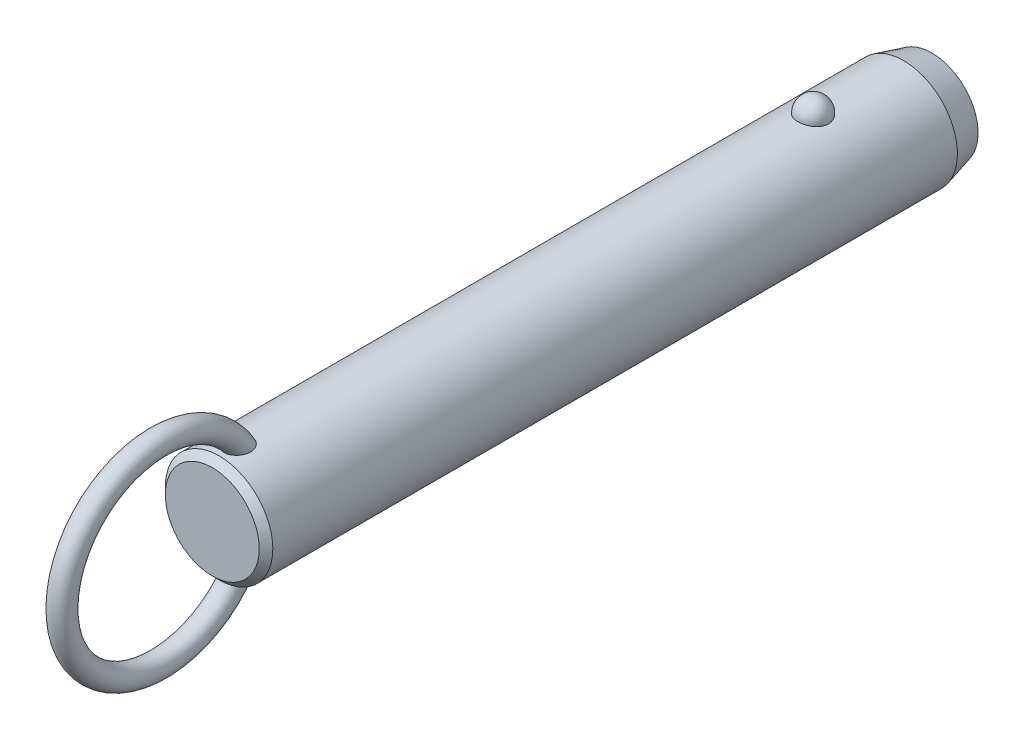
ISO-10303-21;
HEADER;
FILE_DESCRIPTION(('STEP AP214'),'2;1');
FILE_NAME('part.step','',(''),(''),'','','');
FILE_SCHEMA(('AUTOMOTIVE_DESIGN { 1 0 10303 214 1 1 1 1 }'));
ENDSEC;
DATA;
#1=APPLICATION_CONTEXT('core data for automotive mechanical design processes');
#2=APPLICATION_PROTOCOL_DEFINITION('international standard','automotive_design',2000,#1);
#3=PRODUCT_CONTEXT('',#1,'mechanical');
#4=PRODUCT('Part','Part','',(#3));
#5=PRODUCT_RELATED_PRODUCT_CATEGORY('part','',(#4));
#6=PRODUCT_DEFINITION_FORMATION('','',#4);
#7=PRODUCT_DEFINITION_CONTEXT('part definition',#1,'design');
#8=PRODUCT_DEFINITION('design','',#6,#7);
#9=PRODUCT_DEFINITION_SHAPE('','',#8);
#10=(LENGTH_UNIT() NAMED_UNIT(*) SI_UNIT(.MILLI.,.METRE.));
#11=(NAMED_UNIT(*) PLANE_ANGLE_UNIT() SI_UNIT($,.RADIAN.));
#12=(NAMED_UNIT(*) SI_UNIT($,.STERADIAN.) SOLID_ANGLE_UNIT());
#13=UNCERTAINTY_MEASURE_WITH_UNIT(LENGTH_MEASURE(1.E-05),#10,'distance_accuracy_value','');
#14=(GEOMETRIC_REPRESENTATION_CONTEXT(3) GLOBAL_UNCERTAINTY_ASSIGNED_CONTEXT((#13)) GLOBAL_UNIT_ASSIGNED_CONTEXT((#10,
#11,#12)) REPRESENTATION_CONTEXT('',''));
#15=CARTESIAN_POINT('',(0.,0.,0.));
#16=DIRECTION('',(0.,0.,1.));
#17=DIRECTION('',(1.,0.,0.));
#18=AXIS2_PLACEMENT_3D('',#15,#16,#17);
#19=CARTESIAN_POINT('',(0.,0.,94.));
#20=DIRECTION('',(0.,0.,-1.));
#21=DIRECTION('',(-1.,0.,0.));
#22=AXIS2_PLACEMENT_3D('',#19,#20,#21);
#23=CYLINDRICAL_SURFACE('',#22,9.5);
#24=CARTESIAN_POINT('',(2.67259918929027,9.11631578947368,-2.70000000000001));
#25=CARTESIAN_POINT('',(2.6725968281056,9.11631786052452,-2.54909854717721));
#26=CARTESIAN_POINT('',(2.66030567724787,9.11994722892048,-2.39816735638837));
#27=CARTESIAN_POINT('',(2.6114347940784,9.13405924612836,-2.10058568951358));
#28=CARTESIAN_POINT('',(2.57484658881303,9.14454428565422,-1.95393672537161));
#29=CARTESIAN_POINT('',(2.47830875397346,9.17117631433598,-1.66916069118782));
#30=CARTESIAN_POINT('',(2.41836936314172,9.18732082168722,-1.53102991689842));
#31=CARTESIAN_POINT('',(2.27661331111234,9.22346780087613,-1.26705393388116));
#32=CARTESIAN_POINT('',(2.19479699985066,9.24347021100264,-1.14120852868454));
#33=CARTESIAN_POINT('',(2.01085282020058,9.28522401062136,-0.904632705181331));
#34=CARTESIAN_POINT('',(1.90862396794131,9.30698376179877,-0.793982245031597));
#35=CARTESIAN_POINT('',(1.6867437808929,9.34973971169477,-0.591607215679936));
#36=CARTESIAN_POINT('',(1.56709244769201,9.37073591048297,-0.499882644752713));
#37=CARTESIAN_POINT('',(1.31393976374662,9.40956370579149,-0.338167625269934));
#38=CARTESIAN_POINT('',(1.18048026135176,9.42740444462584,-0.268113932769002));
#39=CARTESIAN_POINT('',(0.903154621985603,9.45799906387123,-0.151390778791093));
#40=CARTESIAN_POINT('',(0.759289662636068,9.47075351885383,-0.104718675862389));
#41=CARTESIAN_POINT('',(0.468074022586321,9.48956256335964,-0.0367633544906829));
#42=CARTESIAN_POINT('',(0.320836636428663,9.49573643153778,-0.0150275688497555));
#43=CARTESIAN_POINT('',(0.0246714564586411,9.50112183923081,0.00396199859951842));
#44=CARTESIAN_POINT('',(-0.124256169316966,9.50033406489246,0.00121819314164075));
#45=CARTESIAN_POINT('',(-0.417264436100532,9.4919475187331,-0.0284441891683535));
#46=CARTESIAN_POINT('',(-0.56138413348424,9.48444885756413,-0.0550074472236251));
#47=CARTESIAN_POINT('',(-0.842986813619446,9.46357853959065,-0.131064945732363));
#48=CARTESIAN_POINT('',(-0.980469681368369,9.450206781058,-0.180559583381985));
#49=CARTESIAN_POINT('',(-1.24585005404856,9.41890822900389,-0.301476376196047));
#50=CARTESIAN_POINT('',(-1.37368611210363,9.40095498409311,-0.373026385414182));
#51=CARTESIAN_POINT('',(-1.61552738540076,9.36242964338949,-0.536025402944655));
#52=CARTESIAN_POINT('',(-1.72953116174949,9.34185727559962,-0.627476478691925));
#53=CARTESIAN_POINT('',(-1.9429225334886,9.29984568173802,-0.829844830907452));
#54=CARTESIAN_POINT('',(-2.04198021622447,9.27839736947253,-0.94110821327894));
#55=CARTESIAN_POINT('',(-2.22026460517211,9.23735994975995,-1.17883414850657));
#56=CARTESIAN_POINT('',(-2.29948985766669,9.21777097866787,-1.30529781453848));
#57=CARTESIAN_POINT('',(-2.43697287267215,9.18238994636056,-1.57158566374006));
#58=CARTESIAN_POINT('',(-2.49497068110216,9.16664569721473,-1.71155057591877));
#59=CARTESIAN_POINT('',(-2.5872073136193,9.14104303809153,-1.99961197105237));
#60=CARTESIAN_POINT('',(-2.62144683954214,9.13118445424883,-2.14770821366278));
#61=CARTESIAN_POINT('',(-2.66521466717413,9.11850622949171,-2.44715424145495));
#62=CARTESIAN_POINT('',(-2.67484831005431,9.11565658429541,-2.59848735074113));
#63=CARTESIAN_POINT('',(-2.66946735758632,9.11723375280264,-2.90067317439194));
#64=CARTESIAN_POINT('',(-2.65445345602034,9.12166036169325,-3.05152590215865));
#65=CARTESIAN_POINT('',(-2.60029711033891,9.13724422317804,-3.34766110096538));
#66=CARTESIAN_POINT('',(-2.56127978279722,9.14836656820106,-3.49296833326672));
#67=CARTESIAN_POINT('',(-2.46018844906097,9.17606676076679,-3.77477535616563));
#68=CARTESIAN_POINT('',(-2.39811349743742,9.1926448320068,-3.9112747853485));
#69=CARTESIAN_POINT('',(-2.25202303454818,9.22952198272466,-4.17244273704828));
#70=CARTESIAN_POINT('',(-2.16788714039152,9.24984129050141,-4.29704106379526));
#71=CARTESIAN_POINT('',(-1.9799408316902,9.29188255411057,-4.53013066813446));
#72=CARTESIAN_POINT('',(-1.87612963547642,9.31360456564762,-4.63862130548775));
#73=CARTESIAN_POINT('',(-1.65105429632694,9.35612959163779,-4.8369029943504));
#74=CARTESIAN_POINT('',(-1.52972405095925,9.37692871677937,-4.92661991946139));
#75=CARTESIAN_POINT('',(-1.27318250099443,9.41518970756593,-5.08429106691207));
#76=CARTESIAN_POINT('',(-1.13797219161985,9.432651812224,-5.15224684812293));
#77=CARTESIAN_POINT('',(-0.859280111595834,9.46208255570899,-5.26371827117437));
#78=CARTESIAN_POINT('',(-0.715925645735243,9.47411833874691,-5.30753421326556));
#79=CARTESIAN_POINT('',(-0.423550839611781,9.4916822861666,-5.37076321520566));
#80=CARTESIAN_POINT('',(-0.2745312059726,9.49721125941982,-5.39017930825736));
#81=CARTESIAN_POINT('',(0.0218446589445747,9.50110860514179,-5.40390587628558));
#82=CARTESIAN_POINT('',(0.16917707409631,9.49961381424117,-5.39869609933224));
#83=CARTESIAN_POINT('',(0.460808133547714,9.48993906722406,-5.36441955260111));
#84=CARTESIAN_POINT('',(0.605106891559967,9.48175936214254,-5.33535367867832));
#85=CARTESIAN_POINT('',(0.886027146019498,9.4596376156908,-5.25435587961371));
#86=CARTESIAN_POINT('',(1.02267710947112,9.44571881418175,-5.20251612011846));
#87=CARTESIAN_POINT('',(1.28523827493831,9.41358993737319,-5.07741549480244));
#88=CARTESIAN_POINT('',(1.41114877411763,9.39537958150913,-5.00415322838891));
#89=CARTESIAN_POINT('',(1.65085227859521,9.3562644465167,-4.83684599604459));
#90=CARTESIAN_POINT('',(1.76442346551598,9.33532178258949,-4.74249218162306));
#91=CARTESIAN_POINT('',(1.97425672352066,9.29321198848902,-4.53620389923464));
#92=CARTESIAN_POINT('',(2.07051582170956,9.27204482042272,-4.42426641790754));
#93=CARTESIAN_POINT('',(2.24490086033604,9.23139221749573,-4.18363183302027));
#94=CARTESIAN_POINT('',(2.32267019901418,9.21194380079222,-4.05466990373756));
#95=CARTESIAN_POINT('',(2.45584092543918,9.1773419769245,-3.78517836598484));
#96=CARTESIAN_POINT('',(2.5112497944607,9.16218713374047,-3.64465264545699));
#97=CARTESIAN_POINT('',(2.59380876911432,9.13913522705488,-3.37104301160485));
#98=CARTESIAN_POINT('',(2.62330266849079,9.13064624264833,-3.23871053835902));
#99=CARTESIAN_POINT('',(2.66269870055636,9.11923566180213,-2.97092664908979));
#100=CARTESIAN_POINT('',(2.67260130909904,9.11631393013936,-2.83547530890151));
#101=CARTESIAN_POINT('',(2.67259918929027,9.11631578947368,-2.70000000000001));
#102=B_SPLINE_CURVE_WITH_KNOTS('',3,(#24,#25,#26,#27,#28,#29,#30,#31,#32,#33,#34,#35,#36,#37,
#38,#39,#40,#41,#42,#43,#44,#45,#46,#47,#48,#49,#50,#51,#52,#53,#54,#55,#56,#57,#58,#59,#60,#61,
#62,#63,#64,#65,#66,#67,#68,#69,#70,#71,#72,#73,#74,#75,#76,#77,#78,#79,#80,#81,#82,#83,#84,#85,
#86,#87,#88,#89,#90,#91,#92,#93,#94,#95,#96,#97,#98,#99,#100,#101),.UNSPECIFIED.,.T.,.F.,(4,2,2,
2,2,2,2,2,2,2,2,2,2,2,2,2,2,2,2,2,2,2,2,2,2,2,2,2,2,2,2,2,2,2,2,2,2,2,4),(0.,0.452217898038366,
0.904593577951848,1.35677112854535,1.80894144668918,2.26340676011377,2.71787203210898,
3.17099820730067,3.62407318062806,4.0687883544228,4.51345969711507,4.95160616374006,
5.38976021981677,5.83050358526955,6.27129275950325,6.72071308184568,7.17016633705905,
7.62495278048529,8.07972578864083,8.53254856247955,8.98535859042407,9.43582813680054,
9.88631615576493,10.3393155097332,10.7923328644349,11.2471065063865,11.7018475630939,
12.150795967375,12.599688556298,13.0398725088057,13.4800399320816,13.9184421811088,
14.3568730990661,14.802202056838,15.2476074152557,15.7010097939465,16.1542603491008,
16.5602594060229,16.966248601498),.UNSPECIFIED.);
#103=CARTESIAN_POINT('',(2.67259918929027,9.11631578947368,-2.70000000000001));
#104=VERTEX_POINT('',#103);
#105=EDGE_CURVE('E41',#104,#104,#102,.T.);
#106=ORIENTED_EDGE('',*,*,#105,.T.);
#107=EDGE_LOOP('',(#106));
#108=FACE_BOUND('',#107,.T.);
#109=CARTESIAN_POINT('',(0.,0.,102.32));
#110=DIRECTION('',(0.,0.,1.));
#111=DIRECTION('',(1.,0.,0.));
#112=AXIS2_PLACEMENT_3D('',#109,#110,#111);
#113=CIRCLE('',#112,9.5);
#114=CARTESIAN_POINT('',(9.5,0.,102.32));
#115=VERTEX_POINT('',#114);
#116=EDGE_CURVE('E10',#115,#115,#113,.F.);
#117=ORIENTED_EDGE('',*,*,#116,.T.);
#118=EDGE_LOOP('',(#117));
#119=FACE_BOUND('',#118,.T.);
#120=CARTESIAN_POINT('',(-0.697062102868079,-9.47439269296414,96.6678088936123));
#121=CARTESIAN_POINT('',(-0.799579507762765,-9.46685146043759,96.7074823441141));
#122=CARTESIAN_POINT('',(-0.898575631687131,-9.45788043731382,96.7559309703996));
#123=CARTESIAN_POINT('',(-1.08670047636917,-9.43811593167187,96.8688685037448));
#124=CARTESIAN_POINT('',(-1.17583204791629,-9.42732297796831,96.9333527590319));
#125=CARTESIAN_POINT('',(-1.34179806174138,-9.40513672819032,97.0762099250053));
#126=CARTESIAN_POINT('',(-1.41865133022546,-9.39374438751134,97.154561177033));
#127=CARTESIAN_POINT('',(-1.5586004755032,-9.37154196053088,97.3227524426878));
#128=CARTESIAN_POINT('',(-1.62169476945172,-9.3607319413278,97.4125937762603));
#129=CARTESIAN_POINT('',(-1.73527695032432,-9.34035749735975,97.6045001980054));
#130=CARTESIAN_POINT('',(-1.7852226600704,-9.33085270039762,97.7068910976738));
#131=CARTESIAN_POINT('',(-1.86924997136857,-9.3143834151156,97.918148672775));
#132=CARTESIAN_POINT('',(-1.90332570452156,-9.30741986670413,98.0270177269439));
#133=CARTESIAN_POINT('',(-1.95893603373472,-9.29588482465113,98.2604730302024));
#134=CARTESIAN_POINT('',(-1.97872420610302,-9.29165182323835,98.3854890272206));
#135=CARTESIAN_POINT('',(-2.00062129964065,-9.28695978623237,98.6370805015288));
#136=CARTESIAN_POINT('',(-2.00272284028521,-9.28650232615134,98.763656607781));
#137=CARTESIAN_POINT('',(-1.98958876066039,-9.28932750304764,99.0368157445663));
#138=CARTESIAN_POINT('',(-1.97143366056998,-9.2932400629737,99.1832519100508));
#139=CARTESIAN_POINT('',(-1.91479925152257,-9.30507151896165,99.4720629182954));
#140=CARTESIAN_POINT('',(-1.87629122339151,-9.31299607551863,99.614431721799));
#141=CARTESIAN_POINT('',(-1.77225683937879,-9.33340232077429,99.9151725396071));
#142=CARTESIAN_POINT('',(-1.70334898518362,-9.34641636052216,100.072369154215));
#143=CARTESIAN_POINT('',(-1.58111062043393,-9.36759153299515,100.297517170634));
#144=CARTESIAN_POINT('',(-1.53721459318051,-9.37492619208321,100.370796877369));
#145=CARTESIAN_POINT('',(-1.44302631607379,-9.38988566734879,100.51307405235));
#146=CARTESIAN_POINT('',(-1.39273721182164,-9.39751033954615,100.582073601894));
#147=CARTESIAN_POINT('',(-1.26775962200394,-9.41530678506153,100.736983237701));
#148=CARTESIAN_POINT('',(-1.19052326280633,-9.42548108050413,100.820871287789));
#149=CARTESIAN_POINT('',(-1.02420241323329,-9.44499825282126,100.976008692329));
#150=CARTESIAN_POINT('',(-0.935139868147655,-9.45434261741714,101.047280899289));
#151=CARTESIAN_POINT('',(-0.766610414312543,-9.46930670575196,101.158695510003));
#152=CARTESIAN_POINT('',(-0.689439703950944,-9.47529223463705,101.202235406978));
#153=CARTESIAN_POINT('',(-0.528942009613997,-9.48560294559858,101.27631336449));
#154=CARTESIAN_POINT('',(-0.445620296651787,-9.48992953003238,101.306862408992));
#155=CARTESIAN_POINT('',(-0.273901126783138,-9.49644161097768,101.352579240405));
#156=CARTESIAN_POINT('',(-0.185465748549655,-9.49860811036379,101.36761059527));
#157=CARTESIAN_POINT('',(-0.00734541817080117,-9.5004135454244,101.380149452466));
#158=CARTESIAN_POINT('',(0.0823387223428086,-9.50005405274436,101.377667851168));
#159=CARTESIAN_POINT('',(0.247679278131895,-9.49708301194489,101.356995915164));
#160=CARTESIAN_POINT('',(0.323620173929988,-9.49477609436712,101.340930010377));
#161=CARTESIAN_POINT('',(0.471981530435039,-9.48855917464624,101.297172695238));
#162=CARTESIAN_POINT('',(0.544400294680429,-9.48464840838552,101.269475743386));
#163=CARTESIAN_POINT('',(0.70894789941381,-9.47398336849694,101.19280266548));
#164=CARTESIAN_POINT('',(0.799149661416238,-9.46671310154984,101.139774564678));
#165=CARTESIAN_POINT('',(0.969783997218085,-9.45076225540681,101.019973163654));
#166=CARTESIAN_POINT('',(1.05019415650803,-9.44207854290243,100.953169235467));
#167=CARTESIAN_POINT('',(1.23092343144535,-9.42051459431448,100.780759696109));
#168=CARTESIAN_POINT('',(1.3265249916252,-9.40733378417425,100.67026193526));
#169=CARTESIAN_POINT('',(1.49893121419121,-9.38140745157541,100.435561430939));
#170=CARTESIAN_POINT('',(1.57571616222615,-9.36866239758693,100.311344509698));
#171=CARTESIAN_POINT('',(1.71285426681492,-9.34457644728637,100.049389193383));
#172=CARTESIAN_POINT('',(1.77266365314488,-9.33328726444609,99.9113623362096));
#173=CARTESIAN_POINT('',(1.87239208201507,-9.31379209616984,99.6280515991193));
#174=CARTESIAN_POINT('',(1.9123015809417,-9.3055875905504,99.482764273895));
#175=CARTESIAN_POINT('',(1.97604189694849,-9.29228394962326,99.1620281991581));
#176=CARTESIAN_POINT('',(1.99587438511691,-9.28797202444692,98.9857248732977));
#177=CARTESIAN_POINT('',(2.0029570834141,-9.28645519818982,98.6324146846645));
#178=CARTESIAN_POINT('',(1.99025930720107,-9.28923895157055,98.4554093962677));
#179=CARTESIAN_POINT('',(1.93735479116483,-9.30038134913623,98.1563381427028));
#180=CARTESIAN_POINT('',(1.90576827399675,-9.30697680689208,98.0326679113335));
#181=CARTESIAN_POINT('',(1.82287484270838,-9.32356855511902,97.792329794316));
#182=CARTESIAN_POINT('',(1.77158213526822,-9.33356239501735,97.6756569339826));
#183=CARTESIAN_POINT('',(1.64885744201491,-9.35602275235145,97.4527061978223));
#184=CARTESIAN_POINT('',(1.57730995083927,-9.36850332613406,97.3464927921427));
#185=CARTESIAN_POINT('',(1.4154326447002,-9.39431873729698,97.1495530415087));
#186=CARTESIAN_POINT('',(1.32510883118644,-9.40765330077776,97.0588217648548));
#187=CARTESIAN_POINT('',(1.13846223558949,-9.43195720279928,96.9050334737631));
#188=CARTESIAN_POINT('',(1.04369890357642,-9.44302894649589,96.8400947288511));
#189=CARTESIAN_POINT('',(0.843965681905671,-9.46296805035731,96.7280388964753));
#190=CARTESIAN_POINT('',(0.739000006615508,-9.47183631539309,96.6809144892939));
#191=CARTESIAN_POINT('',(0.528175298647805,-9.48586140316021,96.6081173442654));
#192=CARTESIAN_POINT('',(0.422686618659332,-9.49119633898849,96.5814024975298));
#193=CARTESIAN_POINT('',(0.208590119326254,-9.49831365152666,96.5460137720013));
#194=CARTESIAN_POINT('',(0.0999817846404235,-9.500095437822,96.5373428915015));
#195=CARTESIAN_POINT('',(-0.126104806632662,-9.49988861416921,96.5383501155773));
#196=CARTESIAN_POINT('',(-0.24357872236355,-9.49757821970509,96.5495942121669));
#197=CARTESIAN_POINT('',(-0.474390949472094,-9.48885165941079,96.593167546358));
#198=CARTESIAN_POINT('',(-0.587729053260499,-9.48243528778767,96.6254978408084));
#199=CARTESIAN_POINT('',(-0.697062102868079,-9.47439269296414,96.6678088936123));
#200=B_SPLINE_CURVE_WITH_KNOTS('',3,(#120,#121,#122,#123,#124,#125,#126,#127,#128,#129,#130,
#131,#132,#133,#134,#135,#136,#137,#138,#139,#140,#141,#142,#143,#144,#145,#146,#147,#148,#149,
#150,#151,#152,#153,#154,#155,#156,#157,#158,#159,#160,#161,#162,#163,#164,#165,#166,#167,#168,
#169,#170,#171,#172,#173,#174,#175,#176,#177,#178,#179,#180,#181,#182,#183,#184,#185,#186,#187,
#188,#189,#190,#191,#192,#193,#194,#195,#196,#197,#198,#199),.UNSPECIFIED.,.T.,.F.,(4,2,2,2,2,2,
2,2,2,2,2,2,2,2,2,2,2,2,2,2,2,2,2,2,2,2,2,2,2,2,2,2,2,2,2,2,2,2,2,4),(0.,0.330119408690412,
0.660143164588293,0.989655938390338,1.31920659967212,1.66074728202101,2.00241415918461,
2.38088696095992,2.7595176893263,3.20065679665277,3.6424200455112,4.15620996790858,
4.41314162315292,4.66994734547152,5.01228664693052,5.35399933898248,5.61943037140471,
5.88463652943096,6.15215502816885,6.41950709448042,6.65144391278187,6.88349136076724,
7.19641200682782,7.51003602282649,7.94779711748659,8.38601491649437,8.83699707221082,
9.28819530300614,9.81778662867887,10.3465317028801,10.7284172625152,11.110028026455,
11.4938603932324,11.8775702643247,12.2220189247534,12.5663259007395,12.8915939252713,
13.2169159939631,13.5689650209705,13.9210316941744),.UNSPECIFIED.);
#201=CARTESIAN_POINT('',(-0.697062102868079,-9.47439269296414,96.6678088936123));
#202=VERTEX_POINT('',#201);
#203=EDGE_CURVE('E60',#202,#202,#200,.T.);
#204=ORIENTED_EDGE('',*,*,#203,.T.);
#205=EDGE_LOOP('',(#204));
#206=FACE_BOUND('',#205,.T.);
#207=CARTESIAN_POINT('',(-0.697062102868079,9.47439269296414,96.6678088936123));
#208=CARTESIAN_POINT('',(-0.597792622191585,9.48169483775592,96.6293956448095));
#209=CARTESIAN_POINT('',(-0.495106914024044,9.48766580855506,96.5991682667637));
#210=CARTESIAN_POINT('',(-0.285876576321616,9.49627648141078,96.5560327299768));
#211=CARTESIAN_POINT('',(-0.179324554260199,9.49890941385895,96.5431597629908));
#212=CARTESIAN_POINT('',(0.0344157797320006,9.50053798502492,96.5351666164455));
#213=CARTESIAN_POINT('',(0.141603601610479,9.49953613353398,96.5400341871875));
#214=CARTESIAN_POINT('',(0.353563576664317,9.49401038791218,96.5673654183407));
#215=CARTESIAN_POINT('',(0.458336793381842,9.48948807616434,96.58982117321));
#216=CARTESIAN_POINT('',(0.662493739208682,9.4774236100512,96.6516719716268));
#217=CARTESIAN_POINT('',(0.761881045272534,9.46988348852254,96.6910556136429));
#218=CARTESIAN_POINT('',(0.952608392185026,9.45260382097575,96.7856342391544));
#219=CARTESIAN_POINT('',(1.04394806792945,9.44286417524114,96.8408299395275));
#220=CARTESIAN_POINT('',(1.21712767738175,9.42211760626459,96.9660662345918));
#221=CARTESIAN_POINT('',(1.29885671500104,9.41109835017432,97.0362579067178));
#222=CARTESIAN_POINT('',(1.44978975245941,9.38903310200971,97.188980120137));
#223=CARTESIAN_POINT('',(1.51899278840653,9.37798710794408,97.2715116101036));
#224=CARTESIAN_POINT('',(1.64602857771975,9.35654375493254,97.4497763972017));
#225=CARTESIAN_POINT('',(1.70333052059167,9.34618688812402,97.5458916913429));
#226=CARTESIAN_POINT('',(1.80259341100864,9.32755128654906,97.745897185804));
#227=CARTESIAN_POINT('',(1.84454942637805,9.31927322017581,97.8497898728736));
#228=CARTESIAN_POINT('',(1.91637039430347,9.30478365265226,98.072213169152));
#229=CARTESIAN_POINT('',(1.944805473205,9.29882552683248,98.1912192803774));
#230=CARTESIAN_POINT('',(1.98449865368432,9.29043398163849,98.4321436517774));
#231=CARTESIAN_POINT('',(1.99574908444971,9.28800213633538,98.5540631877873));
#232=CARTESIAN_POINT('',(2.00275141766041,9.28649645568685,98.8169324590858));
#233=CARTESIAN_POINT('',(1.99588238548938,9.28799035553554,98.9579529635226));
#234=CARTESIAN_POINT('',(1.96270559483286,9.29505517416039,99.2376217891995));
#235=CARTESIAN_POINT('',(1.93637872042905,9.30063010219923,99.376267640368));
#236=CARTESIAN_POINT('',(1.85949176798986,9.31633564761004,99.6725616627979));
#237=CARTESIAN_POINT('',(1.80549792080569,9.3270926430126,99.8292907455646));
#238=CARTESIAN_POINT('',(1.67376869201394,9.3516306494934,100.132284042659));
#239=CARTESIAN_POINT('',(1.59603181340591,9.36541185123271,100.278547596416));
#240=CARTESIAN_POINT('',(1.4360277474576,9.39110706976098,100.525813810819));
#241=CARTESIAN_POINT('',(1.35831795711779,9.40278656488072,100.629791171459));
#242=CARTESIAN_POINT('',(1.18774483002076,9.42585025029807,100.824534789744));
#243=CARTESIAN_POINT('',(1.09490932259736,9.43723493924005,100.915324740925));
#244=CARTESIAN_POINT('',(0.921110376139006,9.45552616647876,101.05620334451));
#245=CARTESIAN_POINT('',(0.843738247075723,9.46281058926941,101.110656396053));
#246=CARTESIAN_POINT('',(0.681245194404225,9.47589120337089,101.206711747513));
#247=CARTESIAN_POINT('',(0.596135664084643,9.48168953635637,101.248332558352));
#248=CARTESIAN_POINT('',(0.433779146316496,9.49038144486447,101.310089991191));
#249=CARTESIAN_POINT('',(0.357459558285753,9.49359170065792,101.33260136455));
#250=CARTESIAN_POINT('',(0.202074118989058,9.49816761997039,101.364574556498));
#251=CARTESIAN_POINT('',(0.123010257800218,9.49953459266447,101.374045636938));
#252=CARTESIAN_POINT('',(-0.0357372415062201,9.50026497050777,101.379114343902));
#253=CARTESIAN_POINT('',(-0.115421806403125,9.49962433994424,101.374684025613));
#254=CARTESIAN_POINT('',(-0.272823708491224,9.49640854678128,101.352296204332));
#255=CARTESIAN_POINT('',(-0.350540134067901,9.4938325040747,101.334332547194));
#256=CARTESIAN_POINT('',(-0.500580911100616,9.4870946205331,101.286802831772));
#257=CARTESIAN_POINT('',(-0.57297929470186,9.48296359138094,101.257461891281));
#258=CARTESIAN_POINT('',(-0.712864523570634,9.47347609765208,101.189008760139));
#259=CARTESIAN_POINT('',(-0.780349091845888,9.46811906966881,101.149892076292));
#260=CARTESIAN_POINT('',(-0.94630921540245,9.45329720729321,101.039432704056));
#261=CARTESIAN_POINT('',(-1.04090230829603,9.44321512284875,100.962329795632));
#262=CARTESIAN_POINT('',(-1.21661929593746,9.42219227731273,100.79409718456));
#263=CARTESIAN_POINT('',(-1.2977051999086,9.41124921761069,100.702929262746));
#264=CARTESIAN_POINT('',(-1.47319646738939,9.38563439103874,100.476162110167));
#265=CARTESIAN_POINT('',(-1.5620887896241,9.37102009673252,100.336289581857));
#266=CARTESIAN_POINT('',(-1.71623987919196,9.34401559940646,100.043950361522));
#267=CARTESIAN_POINT('',(-1.78147866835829,9.33162728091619,99.891473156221));
#268=CARTESIAN_POINT('',(-1.88853837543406,9.31055541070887,99.5756470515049));
#269=CARTESIAN_POINT('',(-1.92998995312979,9.30193076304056,99.4121685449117));
#270=CARTESIAN_POINT('',(-1.98590726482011,9.29015757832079,99.0805268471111));
#271=CARTESIAN_POINT('',(-2.0004070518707,9.2870021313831,98.9123698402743));
#272=CARTESIAN_POINT('',(-1.99964701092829,9.28716218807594,98.6050806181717));
#273=CARTESIAN_POINT('',(-1.98908145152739,9.28945704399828,98.4659362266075));
#274=CARTESIAN_POINT('',(-1.94566294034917,9.29865169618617,98.1911539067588));
#275=CARTESIAN_POINT('',(-1.91282062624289,9.30554929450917,98.055514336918));
#276=CARTESIAN_POINT('',(-1.84582133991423,9.31898248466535,97.8578026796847));
#277=CARTESIAN_POINT('',(-1.82038084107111,9.32400364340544,97.792583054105));
#278=CARTESIAN_POINT('',(-1.76350511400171,9.33492884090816,97.6649033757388));
#279=CARTESIAN_POINT('',(-1.73207305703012,9.34083241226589,97.6024418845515));
#280=CARTESIAN_POINT('',(-1.6632424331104,9.353333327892,97.4809407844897));
#281=CARTESIAN_POINT('',(-1.62584239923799,9.35993084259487,97.421902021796));
#282=CARTESIAN_POINT('',(-1.54527678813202,9.37356864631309,97.3079875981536));
#283=CARTESIAN_POINT('',(-1.50211241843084,9.38060884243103,97.2531110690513));
#284=CARTESIAN_POINT('',(-1.37681147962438,9.40004442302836,97.1099619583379));
#285=CARTESIAN_POINT('',(-1.28916358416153,9.41261047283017,97.0264295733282));
#286=CARTESIAN_POINT('',(-1.09996826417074,9.43658180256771,96.8772360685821));
#287=CARTESIAN_POINT('',(-0.998461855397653,9.44799034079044,96.8115238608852));
#288=CARTESIAN_POINT('',(-0.860188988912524,9.46103017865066,96.7394367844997));
#289=CARTESIAN_POINT('',(-0.828141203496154,9.46389141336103,96.7238511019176));
#290=CARTESIAN_POINT('',(-0.763210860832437,9.46934915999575,96.6944734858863));
#291=CARTESIAN_POINT('',(-0.730328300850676,9.47194567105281,96.6806815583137));
#292=CARTESIAN_POINT('',(-0.697062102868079,9.47439269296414,96.6678088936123));
#293=B_SPLINE_CURVE_WITH_KNOTS('',3,(#207,#208,#209,#210,#211,#212,#213,#214,#215,#216,#217,
#218,#219,#220,#221,#222,#223,#224,#225,#226,#227,#228,#229,#230,#231,#232,#233,#234,#235,#236,
#237,#238,#239,#240,#241,#242,#243,#244,#245,#246,#247,#248,#249,#250,#251,#252,#253,#254,#255,
#256,#257,#258,#259,#260,#261,#262,#263,#264,#265,#266,#267,#268,#269,#270,#271,#272,#273,#274,
#275,#276,#277,#278,#279,#280,#281,#282,#283,#284,#285,#286,#287,#288,#289,#290,#291,#292),
.UNSPECIFIED.,.T.,.F.,(4,2,2,2,2,2,2,2,2,2,2,2,2,2,2,2,2,2,2,2,2,2,2,2,2,2,2,2,2,2,2,2,2,2,2,2,
2,2,2,2,2,2,4),(0.,0.319942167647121,0.640532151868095,0.960900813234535,1.28112555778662,
1.60113495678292,1.92115886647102,2.24457323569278,2.56801248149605,2.90371927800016,
3.23953387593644,3.60560313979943,3.97183576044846,4.39383693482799,4.81625324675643,
5.31257045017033,5.80891895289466,6.19868344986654,6.58773876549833,6.87145417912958,
7.15475838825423,7.3926375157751,7.63034760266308,7.86853584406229,8.10683246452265,
8.3406366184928,8.57454843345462,8.93983939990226,9.30614105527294,9.80266668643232,
10.2996107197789,10.8040753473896,11.3079021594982,11.7249776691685,12.1418541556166,
12.3521485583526,12.562331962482,12.7725671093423,12.9827582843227,13.3458276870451,
13.7078449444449,13.8150604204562,13.9222762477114),.UNSPECIFIED.);
#294=CARTESIAN_POINT('',(-0.697062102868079,9.47439269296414,96.6678088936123));
#295=VERTEX_POINT('',#294);
#296=EDGE_CURVE('E67',#295,#295,#293,.T.);
#297=ORIENTED_EDGE('',*,*,#296,.T.);
#298=EDGE_LOOP('',(#297));
#299=FACE_BOUND('',#298,.T.);
#300=CARTESIAN_POINT('',(0.,0.,-18.6999999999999));
#301=DIRECTION('',(0.,0.,-1.));
#302=DIRECTION('',(-1.,0.,0.));
#303=AXIS2_PLACEMENT_3D('',#300,#301,#302);
#304=CIRCLE('',#303,9.5);
#305=CARTESIAN_POINT('',(-9.5,0.,-18.6999999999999));
#306=VERTEX_POINT('',#305);
#307=EDGE_CURVE('E57',#306,#306,#304,.F.);
#308=ORIENTED_EDGE('',*,*,#307,.T.);
#309=EDGE_LOOP('',(#308));
#310=FACE_BOUND('',#309,.T.);
#311=ADVANCED_FACE('F37',(#108,#119,#206,#299,#310),#23,.T.);
#312=CARTESIAN_POINT('',(0.,0.,-23.7));
#313=DIRECTION('',(0.,0.,-1.));
#314=DIRECTION('',(-1.,0.,0.));
#315=AXIS2_PLACEMENT_3D('',#312,#313,#314);
#316=PLANE('',#315);
#317=CARTESIAN_POINT('',(0.,0.,-23.7));
#318=DIRECTION('',(0.,0.,-1.));
#319=DIRECTION('',(-1.,0.,0.));
#320=AXIS2_PLACEMENT_3D('',#317,#318,#319);
#321=CIRCLE('',#320,8.16025403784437);
#322=CARTESIAN_POINT('',(-8.16025403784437,0.,-23.7));
#323=VERTEX_POINT('',#322);
#324=EDGE_CURVE('E66',#323,#323,#321,.T.);
#325=ORIENTED_EDGE('',*,*,#324,.T.);
#326=EDGE_LOOP('',(#325));
#327=FACE_BOUND('',#326,.T.);
#328=ADVANCED_FACE('F85',(#327),#316,.T.);
#329=CARTESIAN_POINT('',(0.,0.,-23.7));
#330=DIRECTION('',(0.,0.,1.));
#331=DIRECTION('',(1.,0.,0.));
#332=AXIS2_PLACEMENT_3D('',#329,#330,#331);
#333=CONICAL_SURFACE('',#332,8.16025403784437,0.261799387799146);
#334=ORIENTED_EDGE('',*,*,#307,.F.);
#335=EDGE_LOOP('',(#334));
#336=FACE_BOUND('',#335,.T.);
#337=ORIENTED_EDGE('',*,*,#324,.F.);
#338=EDGE_LOOP('',(#337));
#339=FACE_BOUND('',#338,.T.);
#340=ADVANCED_FACE('F83',(#336,#339),#333,.T.);
#341=CARTESIAN_POINT('',(0.,0.,103.52));
#342=DIRECTION('',(0.,0.,1.));
#343=DIRECTION('',(1.,0.,0.));
#344=AXIS2_PLACEMENT_3D('',#341,#342,#343);
#345=PLANE('',#344);
#346=CARTESIAN_POINT('',(0.,0.,103.52));
#347=DIRECTION('',(0.,0.,1.));
#348=DIRECTION('',(1.,0.,0.));
#349=AXIS2_PLACEMENT_3D('',#346,#347,#348);
#350=CIRCLE('',#349,8.3);
#351=CARTESIAN_POINT('',(8.3,0.,103.52));
#352=VERTEX_POINT('',#351);
#353=EDGE_CURVE('E50',#352,#352,#350,.T.);
#354=ORIENTED_EDGE('',*,*,#353,.T.);
#355=EDGE_LOOP('',(#354));
#356=FACE_BOUND('',#355,.T.);
#357=ADVANCED_FACE('F77',(#356),#345,.T.);
#358=CARTESIAN_POINT('',(0.,0.,113.05));
#359=DIRECTION('',(1.,0.,0.));
#360=DIRECTION('',(0.,0.,-1.));
#361=AXIS2_PLACEMENT_3D('',#358,#359,#360);
#362=TOROIDAL_SURFACE('',#361,17.05,2.);
#363=ORIENTED_EDGE('',*,*,#296,.F.);
#364=EDGE_LOOP('',(#363));
#365=FACE_BOUND('',#364,.T.);
#366=ORIENTED_EDGE('',*,*,#203,.F.);
#367=EDGE_LOOP('',(#366));
#368=FACE_BOUND('',#367,.T.);
#369=ADVANCED_FACE('F73',(#365,#368),#362,.T.);
#370=CARTESIAN_POINT('',(0.,0.,103.52));
#371=DIRECTION('',(0.,0.,-1.));
#372=DIRECTION('',(-1.,0.,0.));
#373=AXIS2_PLACEMENT_3D('',#370,#371,#372);
#374=CONICAL_SURFACE('',#373,8.3,0.78539816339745);
#375=ORIENTED_EDGE('',*,*,#116,.F.);
#376=EDGE_LOOP('',(#375));
#377=FACE_BOUND('',#376,.T.);
#378=ORIENTED_EDGE('',*,*,#353,.F.);
#379=EDGE_LOOP('',(#378));
#380=FACE_BOUND('',#379,.T.);
#381=ADVANCED_FACE('F39',(#377,#380),#374,.T.);
#382=CARTESIAN_POINT('',(0.,9.5,-2.70000000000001));
#383=DIRECTION('',(0.,1.,0.));
#384=DIRECTION('',(0.,0.,-1.));
#385=AXIS2_PLACEMENT_3D('',#382,#383,#384);
#386=SPHERICAL_SURFACE('',#385,2.7);
#387=ORIENTED_EDGE('',*,*,#105,.F.);
#388=EDGE_LOOP('',(#387));
#389=FACE_BOUND('',#388,.T.);
#390=ADVANCED_FACE('F79',(#389),#386,.T.);
#391=CLOSED_SHELL('',(#311,#328,#340,#357,#369,#381,#390));
#392=MANIFOLD_SOLID_BREP('B2',#391);
#393=ADVANCED_BREP_SHAPE_REPRESENTATION('',(#18,#392),#14);
#394=SHAPE_DEFINITION_REPRESENTATION(#9,#393);
ENDSEC;
END-ISO-10303-21;
